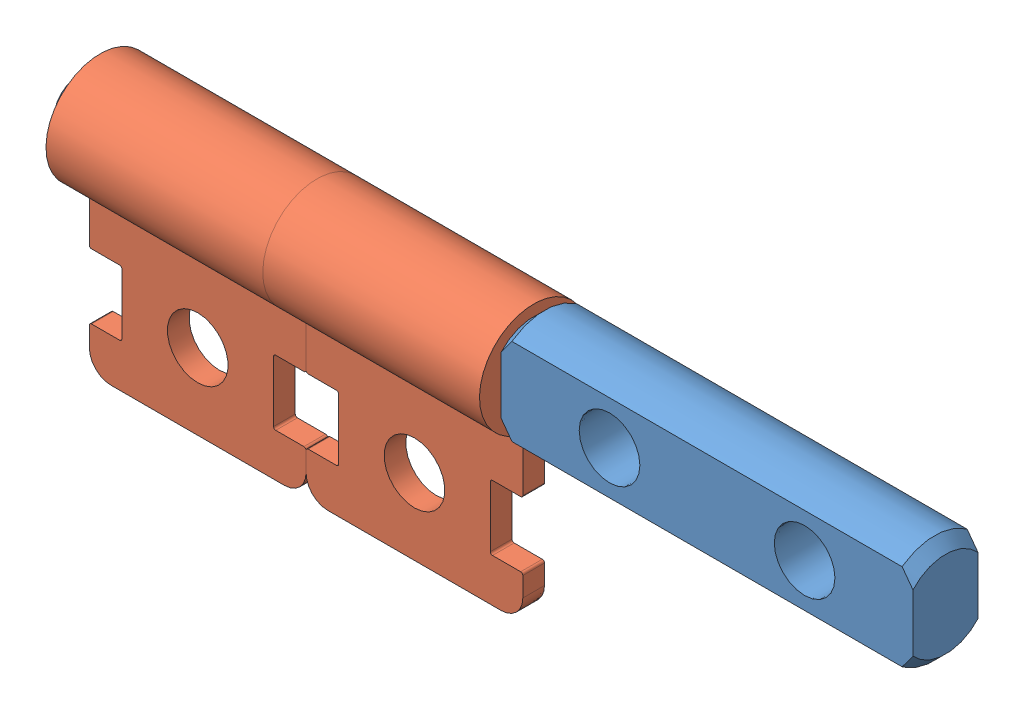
SolidWorks assembly ST080A1.SLDASM, configuration Default (file format 7000). Lengths in mm.
Overall size (40 12.5 5).
3 component instances, 2 part files, 6 mates.
Components (placement in the parent):
- ST080 SHAFT-1: ST080 SHAFT.SLDPRT [ST080B0] at (59.5604 0.3344 40) x (-1 0 0) z (0 0 -1) size (40 5 3)
- ST040 Bracket-1: ST040 Bracket.SLDPRT [Default] at (20.5604 0.3344 40) size (10.06 12.5 5)
- ST040 Bracket-2: ST040 Bracket.SLDPRT [Default] at (30.5604 0.3344 40) size (10.06 12.5 5)
Mates (geometry in assembly coordinates):
- Coincident1: coincident anti-aligned: plane of ST040 Bracket-1 through (30.5604 -2.4941 41) normal (1 0 0); plane of ST040 Bracket-2 through (30.5604 -2.4941 41) normal (-1 0 0)
- Concentric1: concentric aligned: cylinder of ST040 Bracket-1 through (30.5604 0.3344 40) axis (-1 0 0) radius 1.5; cylinder of ST040 Bracket-2 through (40.5604 0.3344 40) axis (-1 0 0) radius 1.5
- Coincident3: coincident aligned: plane of ST040 Bracket-1 through (30.5604 -2.4941 40.5) normal (0 0 1); plane of ST040 Bracket-2 through (40.5604 -2.4941 40.5) normal (0 0 1)
- Coincident4: coincident: plane of ST080 SHAFT-1 through (40.5604 2.3344 40) normal (-1 0 0); plane of ST040 Bracket-2 through (40.5604 -2.4941 41) normal (1 0 0)
- Concentric2: concentric: cylinder of ST080 SHAFT-1 through (59.5604 0.3344 40) axis (1 0 0) radius 1.5; cylinder of ST040 Bracket-2 through (40.5604 0.3344 40) axis (-1 0 0) radius 1.5
- Parallel2: parallel aligned: plane of ST080 SHAFT-1 through (40.5604 -2.1656 41.5) normal (0 0 1); plane of ST040 Bracket-2 through (40.5604 -2.4941 40.5) normal (0 0 1)
